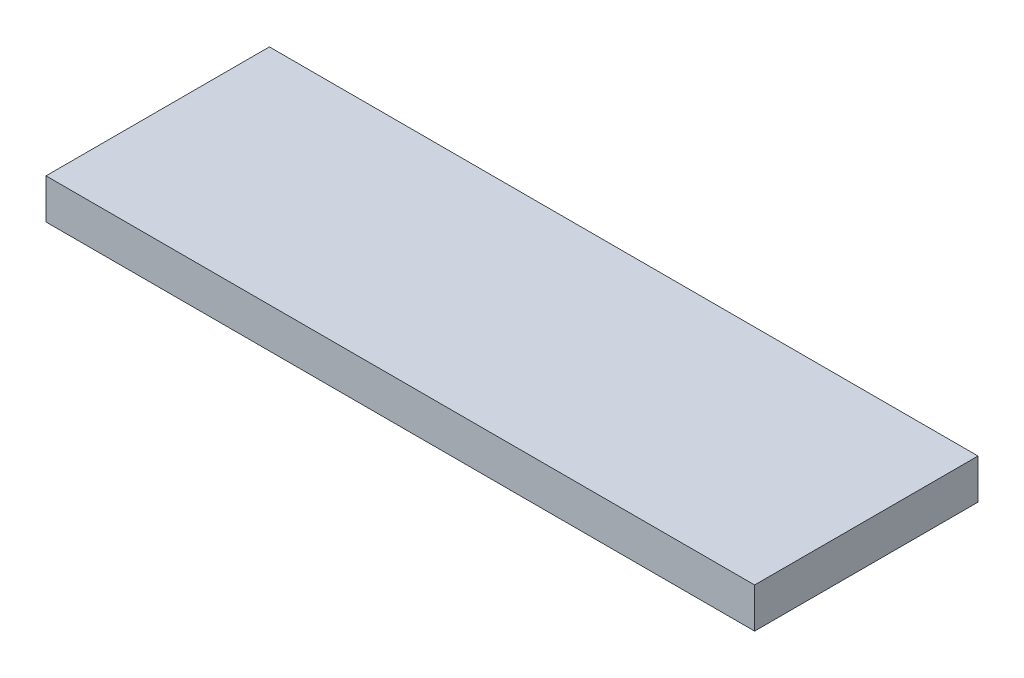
from build123d import *

# Parameters (mm, degrees)
SKETCH1_W      = 415.761360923
SKETCH1_H      = 23.458279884
EXTRUDE1_DEPTH = 131.064


with BuildPart() as part:
    # Sketch1 → Extrude1 (new body)
    with BuildSketch(Plane.XY):
        with Locations((207.880680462, 11.729139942)):
            Rectangle(SKETCH1_W, SKETCH1_H)
    extrude(amount=EXTRUDE1_DEPTH)


solid = part.part
